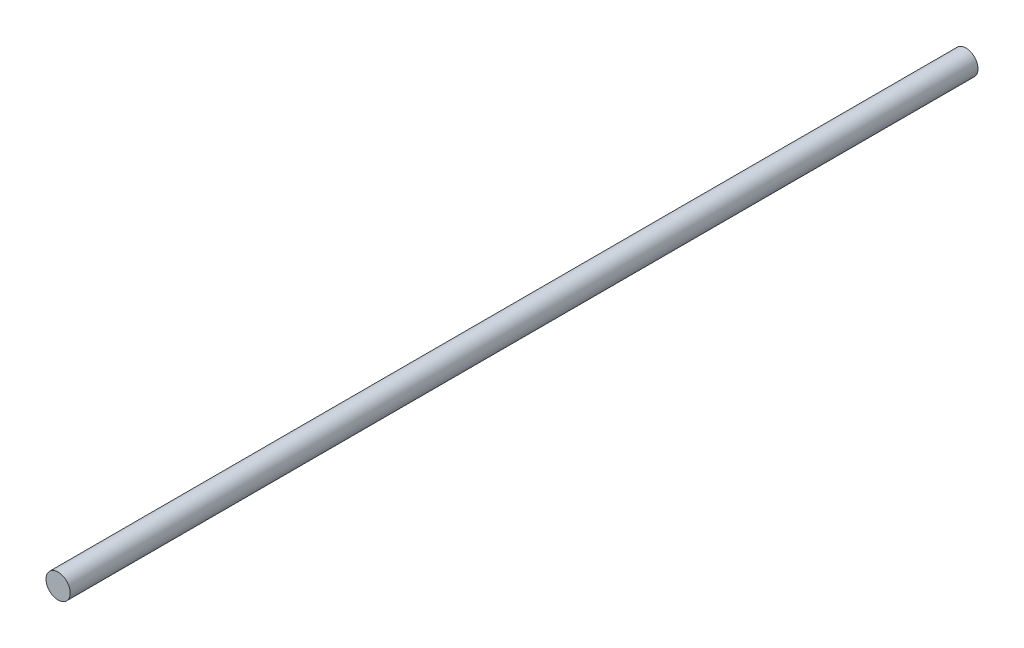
ISO-10303-21;
HEADER;
FILE_DESCRIPTION(('STEP AP214'),'2;1');
FILE_NAME('part.step','',(''),(''),'','','');
FILE_SCHEMA(('AUTOMOTIVE_DESIGN { 1 0 10303 214 1 1 1 1 }'));
ENDSEC;
DATA;
#1=APPLICATION_CONTEXT('core data for automotive mechanical design processes');
#2=APPLICATION_PROTOCOL_DEFINITION('international standard','automotive_design',2000,#1);
#3=PRODUCT_CONTEXT('',#1,'mechanical');
#4=PRODUCT('Part','Part','',(#3));
#5=PRODUCT_RELATED_PRODUCT_CATEGORY('part','',(#4));
#6=PRODUCT_DEFINITION_FORMATION('','',#4);
#7=PRODUCT_DEFINITION_CONTEXT('part definition',#1,'design');
#8=PRODUCT_DEFINITION('design','',#6,#7);
#9=PRODUCT_DEFINITION_SHAPE('','',#8);
#10=(LENGTH_UNIT() NAMED_UNIT(*) SI_UNIT(.MILLI.,.METRE.));
#11=(NAMED_UNIT(*) PLANE_ANGLE_UNIT() SI_UNIT($,.RADIAN.));
#12=(NAMED_UNIT(*) SI_UNIT($,.STERADIAN.) SOLID_ANGLE_UNIT());
#13=UNCERTAINTY_MEASURE_WITH_UNIT(LENGTH_MEASURE(1.E-05),#10,'distance_accuracy_value','');
#14=(GEOMETRIC_REPRESENTATION_CONTEXT(3) GLOBAL_UNCERTAINTY_ASSIGNED_CONTEXT((#13)) GLOBAL_UNIT_ASSIGNED_CONTEXT((#10,
#11,#12)) REPRESENTATION_CONTEXT('',''));
#15=CARTESIAN_POINT('',(0.,0.,0.));
#16=DIRECTION('',(0.,0.,1.));
#17=DIRECTION('',(1.,0.,0.));
#18=AXIS2_PLACEMENT_3D('',#15,#16,#17);
#19=CARTESIAN_POINT('',(0.,0.,-2250.));
#20=DIRECTION('',(0.,0.,1.));
#21=DIRECTION('',(1.,0.,0.));
#22=AXIS2_PLACEMENT_3D('',#19,#20,#21);
#23=CYLINDRICAL_SURFACE('',#22,30.);
#24=CARTESIAN_POINT('',(0.,0.,-2250.));
#25=DIRECTION('',(0.,0.,1.));
#26=DIRECTION('',(1.,0.,0.));
#27=AXIS2_PLACEMENT_3D('',#24,#25,#26);
#28=CIRCLE('',#27,30.);
#29=CARTESIAN_POINT('',(30.,0.,-2250.));
#30=VERTEX_POINT('',#29);
#31=EDGE_CURVE('E10',#30,#30,#28,.T.);
#32=ORIENTED_EDGE('',*,*,#31,.T.);
#33=EDGE_LOOP('',(#32));
#34=FACE_BOUND('',#33,.T.);
#35=CARTESIAN_POINT('',(0.,0.,0.));
#36=DIRECTION('',(0.,0.,1.));
#37=DIRECTION('',(1.,0.,0.));
#38=AXIS2_PLACEMENT_3D('',#35,#36,#37);
#39=CIRCLE('',#38,30.);
#40=CARTESIAN_POINT('',(30.,0.,0.));
#41=VERTEX_POINT('',#40);
#42=EDGE_CURVE('E40',#41,#41,#39,.T.);
#43=ORIENTED_EDGE('',*,*,#42,.F.);
#44=EDGE_LOOP('',(#43));
#45=FACE_BOUND('',#44,.T.);
#46=ADVANCED_FACE('F37',(#34,#45),#23,.T.);
#47=CARTESIAN_POINT('',(0.,0.,-2250.));
#48=DIRECTION('',(0.,0.,1.));
#49=DIRECTION('',(1.,0.,0.));
#50=AXIS2_PLACEMENT_3D('',#47,#48,#49);
#51=PLANE('',#50);
#52=ORIENTED_EDGE('',*,*,#31,.F.);
#53=EDGE_LOOP('',(#52));
#54=FACE_BOUND('',#53,.T.);
#55=ADVANCED_FACE('F54',(#54),#51,.F.);
#56=CARTESIAN_POINT('',(0.,0.,0.));
#57=DIRECTION('',(0.,0.,1.));
#58=DIRECTION('',(1.,0.,0.));
#59=AXIS2_PLACEMENT_3D('',#56,#57,#58);
#60=PLANE('',#59);
#61=ORIENTED_EDGE('',*,*,#42,.T.);
#62=EDGE_LOOP('',(#61));
#63=FACE_BOUND('',#62,.T.);
#64=ADVANCED_FACE('F51',(#63),#60,.T.);
#65=CLOSED_SHELL('',(#46,#55,#64));
#66=MANIFOLD_SOLID_BREP('B2',#65);
#67=ADVANCED_BREP_SHAPE_REPRESENTATION('',(#18,#66),#14);
#68=SHAPE_DEFINITION_REPRESENTATION(#9,#67);
ENDSEC;
END-ISO-10303-21;
